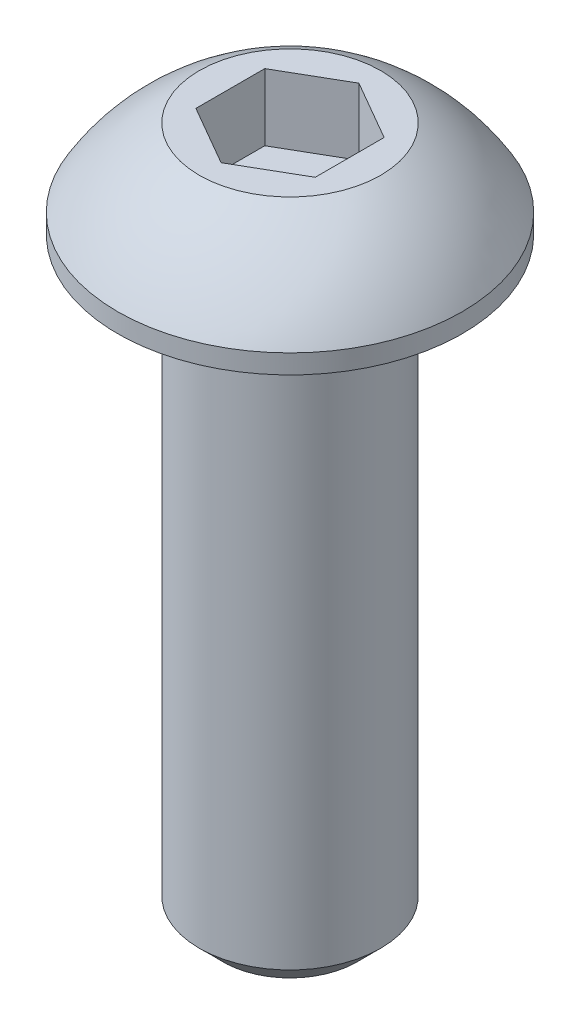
ISO-10303-21;
HEADER;
FILE_DESCRIPTION(('STEP AP214'),'2;1');
FILE_NAME('part.step','',(''),(''),'','','');
FILE_SCHEMA(('AUTOMOTIVE_DESIGN { 1 0 10303 214 1 1 1 1 }'));
ENDSEC;
DATA;
#1=APPLICATION_CONTEXT('core data for automotive mechanical design processes');
#2=APPLICATION_PROTOCOL_DEFINITION('international standard','automotive_design',2000,#1);
#3=PRODUCT_CONTEXT('',#1,'mechanical');
#4=PRODUCT('Part','Part','',(#3));
#5=PRODUCT_RELATED_PRODUCT_CATEGORY('part','',(#4));
#6=PRODUCT_DEFINITION_FORMATION('','',#4);
#7=PRODUCT_DEFINITION_CONTEXT('part definition',#1,'design');
#8=PRODUCT_DEFINITION('design','',#6,#7);
#9=PRODUCT_DEFINITION_SHAPE('','',#8);
#10=(LENGTH_UNIT() NAMED_UNIT(*) SI_UNIT(.MILLI.,.METRE.));
#11=(NAMED_UNIT(*) PLANE_ANGLE_UNIT() SI_UNIT($,.RADIAN.));
#12=(NAMED_UNIT(*) SI_UNIT($,.STERADIAN.) SOLID_ANGLE_UNIT());
#13=UNCERTAINTY_MEASURE_WITH_UNIT(LENGTH_MEASURE(1.E-05),#10,'distance_accuracy_value','');
#14=(GEOMETRIC_REPRESENTATION_CONTEXT(3) GLOBAL_UNCERTAINTY_ASSIGNED_CONTEXT((#13)) GLOBAL_UNIT_ASSIGNED_CONTEXT((#10,
#11,#12)) REPRESENTATION_CONTEXT('',''));
#15=CARTESIAN_POINT('',(0.,0.,0.));
#16=DIRECTION('',(0.,0.,1.));
#17=DIRECTION('',(1.,0.,0.));
#18=AXIS2_PLACEMENT_3D('',#15,#16,#17);
#19=CARTESIAN_POINT('',(0.,0.,0.));
#20=DIRECTION('',(0.,-1.,0.));
#21=DIRECTION('',(0.,0.,-1.));
#22=AXIS2_PLACEMENT_3D('',#19,#20,#21);
#23=PLANE('',#22);
#24=CARTESIAN_POINT('',(0.,0.,0.));
#25=DIRECTION('',(0.,-1.,0.));
#26=DIRECTION('',(0.,0.,-1.));
#27=AXIS2_PLACEMENT_3D('',#24,#25,#26);
#28=CIRCLE('',#27,2.413);
#29=CARTESIAN_POINT('',(0.,0.,-2.413));
#30=VERTEX_POINT('',#29);
#31=EDGE_CURVE('E11',#30,#30,#28,.T.);
#32=ORIENTED_EDGE('',*,*,#31,.F.);
#33=EDGE_LOOP('',(#32));
#34=FACE_BOUND('',#33,.T.);
#35=CARTESIAN_POINT('',(0.,0.,0.));
#36=DIRECTION('',(0.,-1.,0.));
#37=DIRECTION('',(0.,0.,-1.));
#38=AXIS2_PLACEMENT_3D('',#35,#36,#37);
#39=CIRCLE('',#38,4.5847);
#40=CARTESIAN_POINT('',(0.,0.,-4.5847));
#41=VERTEX_POINT('',#40);
#42=EDGE_CURVE('E33',#41,#41,#39,.T.);
#43=ORIENTED_EDGE('',*,*,#42,.T.);
#44=EDGE_LOOP('',(#43));
#45=FACE_BOUND('',#44,.T.);
#46=ADVANCED_FACE('F26',(#34,#45),#23,.T.);
#47=CARTESIAN_POINT('',(0.,0.,0.));
#48=DIRECTION('',(0.,-1.,0.));
#49=DIRECTION('',(0.,0.,-1.));
#50=AXIS2_PLACEMENT_3D('',#47,#48,#49);
#51=CYLINDRICAL_SURFACE('',#50,4.5847);
#52=CARTESIAN_POINT('',(0.,0.508000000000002,0.));
#53=DIRECTION('',(0.,-1.,0.));
#54=DIRECTION('',(0.,0.,-1.));
#55=AXIS2_PLACEMENT_3D('',#52,#53,#54);
#56=CIRCLE('',#55,4.5847);
#57=CARTESIAN_POINT('',(4.58470000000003,0.508000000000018,0.));
#58=VERTEX_POINT('',#57);
#59=EDGE_CURVE('E143',#58,#58,#56,.T.);
#60=ORIENTED_EDGE('',*,*,#59,.T.);
#61=EDGE_LOOP('',(#60));
#62=FACE_BOUND('',#61,.T.);
#63=ORIENTED_EDGE('',*,*,#42,.F.);
#64=EDGE_LOOP('',(#63));
#65=FACE_BOUND('',#64,.T.);
#66=ADVANCED_FACE('F149',(#62,#65),#51,.T.);
#67=CARTESIAN_POINT('',(0.,-2.15653055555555,0.));
#68=DIRECTION('',(0.,-1.,0.));
#69=DIRECTION('',(1.,0.,0.));
#70=AXIS2_PLACEMENT_3D('',#67,#68,#69);
#71=SPHERICAL_SURFACE('',#70,5.30275373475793);
#72=CARTESIAN_POINT('',(0.,2.5654,0.));
#73=DIRECTION('',(0.,-1.,0.));
#74=DIRECTION('',(0.,0.,-1.));
#75=AXIS2_PLACEMENT_3D('',#72,#73,#74);
#76=CIRCLE('',#75,2.413);
#77=CARTESIAN_POINT('',(2.41300000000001,2.56540000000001,0.));
#78=VERTEX_POINT('',#77);
#79=EDGE_CURVE('E140',#78,#78,#76,.T.);
#80=CARTESIAN_POINT('',(2.41300000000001,2.56540000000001,0.));
#81=CARTESIAN_POINT('',(2.44113024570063,2.55102492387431,0.));
#82=CARTESIAN_POINT('',(2.46913200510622,2.53639841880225,0.));
#83=CARTESIAN_POINT('',(2.52486967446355,2.50664734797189,0.));
#84=CARTESIAN_POINT('',(2.55260558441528,2.49152278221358,0.));
#85=CARTESIAN_POINT('',(2.60780267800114,2.4607803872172,0.));
#86=CARTESIAN_POINT('',(2.63526386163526,2.44516255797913,0.));
#87=CARTESIAN_POINT('',(2.68990273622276,2.41343863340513,0.));
#88=CARTESIAN_POINT('',(2.71708042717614,2.3973325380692,0.));
#89=CARTESIAN_POINT('',(2.77114363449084,2.36463722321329,0.));
#90=CARTESIAN_POINT('',(2.79802915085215,2.3480480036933,0.));
#91=CARTESIAN_POINT('',(2.85149942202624,2.31439173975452,0.));
#92=CARTESIAN_POINT('',(2.87808417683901,2.29732469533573,0.));
#93=CARTESIAN_POINT('',(2.93094443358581,2.26271823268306,0.));
#94=CARTESIAN_POINT('',(2.95721993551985,2.24517881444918,0.));
#95=CARTESIAN_POINT('',(3.00945329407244,2.20963320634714,0.));
#96=CARTESIAN_POINT('',(3.03541115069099,2.19162701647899,0.));
#97=CARTESIAN_POINT('',(3.08700092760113,2.15515361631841,0.));
#98=CARTESIAN_POINT('',(3.11263284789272,2.13668640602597,0.));
#99=CARTESIAN_POINT('',(3.16356256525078,2.09929686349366,0.));
#100=CARTESIAN_POINT('',(3.18886036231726,2.08037453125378,0.));
#101=CARTESIAN_POINT('',(3.23911375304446,2.04208078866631,0.));
#102=CARTESIAN_POINT('',(3.26406934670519,2.0227093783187,0.));
#103=CARTESIAN_POINT('',(3.31363035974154,1.98352366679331,0.));
#104=CARTESIAN_POINT('',(3.33823577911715,1.96370936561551,0.));
#105=CARTESIAN_POINT('',(3.38708858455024,1.92364420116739,0.));
#106=CARTESIAN_POINT('',(3.41133597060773,1.90339333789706,0.));
#107=CARTESIAN_POINT('',(3.45946496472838,1.86246151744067,0.));
#108=CARTESIAN_POINT('',(3.48334657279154,1.8417805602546,0.));
#109=CARTESIAN_POINT('',(3.53073638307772,1.79999515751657,0.));
#110=CARTESIAN_POINT('',(3.55424458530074,1.77889071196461,0.));
#111=CARTESIAN_POINT('',(3.60088007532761,1.73626507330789,0.));
#112=CARTESIAN_POINT('',(3.62400736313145,1.71474388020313,0.));
#113=CARTESIAN_POINT('',(3.66987363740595,1.67129162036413,0.));
#114=CARTESIAN_POINT('',(3.69261262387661,1.64936055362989,0.));
#115=CARTESIAN_POINT('',(3.73769503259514,1.60509555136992,0.));
#116=CARTESIAN_POINT('',(3.76003845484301,1.58276161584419,0.));
#117=CARTESIAN_POINT('',(3.80432259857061,1.53769800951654,0.));
#118=CARTESIAN_POINT('',(3.82626332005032,1.51496833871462,0.));
#119=CARTESIAN_POINT('',(3.86973505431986,1.46912052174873,0.));
#120=CARTESIAN_POINT('',(3.89126606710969,1.44600237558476,0.));
#121=CARTESIAN_POINT('',(3.93391150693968,1.39938499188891,0.));
#122=CARTESIAN_POINT('',(3.95502593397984,1.37588575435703,0.));
#123=CARTESIAN_POINT('',(3.99683145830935,1.32851369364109,0.));
#124=CARTESIAN_POINT('',(4.01752255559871,1.30464087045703,0.));
#125=CARTESIAN_POINT('',(4.05847481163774,1.25652926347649,0.));
#126=CARTESIAN_POINT('',(4.07873597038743,1.23229047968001,0.));
#127=CARTESIAN_POINT('',(4.11882187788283,1.18345469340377,0.));
#128=CARTESIAN_POINT('',(4.13864662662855,1.15885769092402,0.));
#129=CARTESIAN_POINT('',(4.17785338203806,1.10931332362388,0.));
#130=CARTESIAN_POINT('',(4.19723538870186,1.0843659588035,0.));
#131=CARTESIAN_POINT('',(4.23555046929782,1.03412883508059,0.));
#132=CARTESIAN_POINT('',(4.25448354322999,1.00883907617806,0.));
#133=CARTESIAN_POINT('',(4.29189471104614,0.957925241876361,0.));
#134=CARTESIAN_POINT('',(4.31037280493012,0.932301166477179,0.));
#135=CARTESIAN_POINT('',(4.34686811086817,0.880726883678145,0.));
#136=CARTESIAN_POINT('',(4.36488532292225,0.854776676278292,0.));
#137=CARTESIAN_POINT('',(4.4004531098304,0.802558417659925,0.));
#138=CARTESIAN_POINT('',(4.41800368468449,0.77629036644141,0.));
#139=CARTESIAN_POINT('',(4.45263259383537,0.723444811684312,0.));
#140=CARTESIAN_POINT('',(4.46971092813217,0.696867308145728,0.));
#141=CARTESIAN_POINT('',(4.50338989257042,0.643411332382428,0.));
#142=CARTESIAN_POINT('',(4.51999052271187,0.61653286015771,0.));
#143=CARTESIAN_POINT('',(4.55270880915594,0.562483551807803,0.));
#144=CARTESIAN_POINT('',(4.56882646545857,0.535312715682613,0.));
#145=CARTESIAN_POINT('',(4.58470000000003,0.508000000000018,0.));
#146=B_SPLINE_CURVE_WITH_KNOTS('',3,(#80,#81,#82,#83,#84,#85,#86,#87,#88,#89,#90,#91,#92,#93,
#94,#95,#96,#97,#98,#99,#100,#101,#102,#103,#104,#105,#106,#107,#108,#109,#110,#111,#112,#113,
#114,#115,#116,#117,#118,#119,#120,#121,#122,#123,#124,#125,#126,#127,#128,#129,#130,#131,#132,
#133,#134,#135,#136,#137,#138,#139,#140,#141,#142,#143,#144,#145),.UNSPECIFIED.,.F.,.F.,(4,2,2,
2,2,2,2,2,2,2,2,2,2,2,2,2,2,2,2,2,2,2,2,2,2,2,2,2,2,2,2,2,4),(0.,0.0947699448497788,
0.189539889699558,0.284309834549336,0.379079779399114,0.473849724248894,0.568619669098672,
0.663389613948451,0.75815955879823,0.852929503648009,0.947699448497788,1.04246939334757,
1.13723933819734,1.23200928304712,1.3267792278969,1.42154917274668,1.51631911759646,
1.61108906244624,1.70585900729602,1.8006289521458,1.89539889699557,1.99016884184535,
2.08493878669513,2.17970873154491,2.27447867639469,2.36924862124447,2.46401856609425,
2.55878851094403,2.6535584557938,2.74832840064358,2.84309834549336,2.93786829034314,
3.03263823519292),.UNSPECIFIED.);
#147=EDGE_CURVE('BSEAM151',#78,#58,#146,.T.);
#148=ORIENTED_EDGE('',*,*,#79,.T.);
#149=ORIENTED_EDGE('',*,*,#59,.F.);
#150=ORIENTED_EDGE('',*,*,#147,.T.);
#151=ORIENTED_EDGE('',*,*,#147,.F.);
#152=EDGE_LOOP('',(#148,#150,#149,#151));
#153=FACE_BOUND('',#152,.T.);
#154=ADVANCED_FACE('F151',(#153),#71,.T.);
#155=CARTESIAN_POINT('',(2.41300000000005,2.56539999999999,0.));
#156=DIRECTION('',(0.,1.,0.));
#157=DIRECTION('',(0.,0.,1.));
#158=AXIS2_PLACEMENT_3D('',#155,#156,#157);
#159=PLANE('',#158);
#160=DIRECTION('',(1.0206947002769E-11,0.,1.));
#161=VECTOR('',#160,1.);
#162=CARTESIAN_POINT('',(-1.58750000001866,2.56540000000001,-0.916543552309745));
#163=LINE('',#162,#161);
#164=CARTESIAN_POINT('',(-1.58750000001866,2.56540000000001,-0.916543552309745));
#165=VERTEX_POINT('',#164);
#166=CARTESIAN_POINT('',(-1.58749999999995,2.56540000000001,0.916543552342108));
#167=VERTEX_POINT('',#166);
#168=EDGE_CURVE('E40',#165,#167,#163,.T.);
#169=ORIENTED_EDGE('',*,*,#168,.F.);
#170=DIRECTION('',(-0.866025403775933,0.,0.500000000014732));
#171=VECTOR('',#170,1.);
#172=CARTESIAN_POINT('',(-2.80053757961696E-11,2.5654,-1.83308710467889));
#173=LINE('',#172,#171);
#174=CARTESIAN_POINT('',(-2.80053757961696E-11,2.5654,-1.83308710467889));
#175=VERTEX_POINT('',#174);
#176=EDGE_CURVE('E110',#175,#165,#173,.T.);
#177=ORIENTED_EDGE('',*,*,#176,.F.);
#178=DIRECTION('',(-0.866025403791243,0.,-0.499999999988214));
#179=VECTOR('',#178,1.);
#180=CARTESIAN_POINT('',(1.58749999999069,2.56539999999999,-0.916543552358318));
#181=LINE('',#180,#179);
#182=CARTESIAN_POINT('',(1.58749999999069,2.56539999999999,-0.916543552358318));
#183=VERTEX_POINT('',#182);
#184=EDGE_CURVE('E104',#183,#175,#181,.T.);
#185=ORIENTED_EDGE('',*,*,#184,.F.);
#186=DIRECTION('',(-1.02068287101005E-11,0.,-1.));
#187=VECTOR('',#186,1.);
#188=CARTESIAN_POINT('',(1.58750000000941,2.56539999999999,0.916543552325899));
#189=LINE('',#188,#187);
#190=CARTESIAN_POINT('',(1.58750000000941,2.56539999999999,0.916543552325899));
#191=VERTEX_POINT('',#190);
#192=EDGE_CURVE('E102',#191,#183,#189,.T.);
#193=ORIENTED_EDGE('',*,*,#192,.F.);
#194=DIRECTION('',(0.866025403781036,0.,-0.500000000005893));
#195=VECTOR('',#194,1.);
#196=CARTESIAN_POINT('',(9.39526234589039E-12,2.5654,1.83308710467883));
#197=LINE('',#196,#195);
#198=CARTESIAN_POINT('',(9.39526234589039E-12,2.5654,1.83308710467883));
#199=VERTEX_POINT('',#198);
#200=EDGE_CURVE('E83',#199,#191,#197,.T.);
#201=ORIENTED_EDGE('',*,*,#200,.F.);
#202=DIRECTION('',(0.86602540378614,0.,0.499999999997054));
#203=VECTOR('',#202,1.);
#204=CARTESIAN_POINT('',(-1.58749999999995,2.56540000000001,0.916543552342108));
#205=LINE('',#204,#203);
#206=EDGE_CURVE('E94',#167,#199,#205,.T.);
#207=ORIENTED_EDGE('',*,*,#206,.F.);
#208=EDGE_LOOP('',(#169,#177,#185,#193,#201,#207));
#209=FACE_BOUND('',#208,.T.);
#210=ORIENTED_EDGE('',*,*,#79,.F.);
#211=EDGE_LOOP('',(#210));
#212=FACE_BOUND('',#211,.T.);
#213=ADVANCED_FACE('F98',(#209,#212),#159,.T.);
#214=CARTESIAN_POINT('',(1.11022302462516E-13,-15.875,0.));
#215=DIRECTION('',(0.,-1.,0.));
#216=DIRECTION('',(0.,0.,-1.));
#217=AXIS2_PLACEMENT_3D('',#214,#215,#216);
#218=PLANE('',#217);
#219=CARTESIAN_POINT('',(1.11022302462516E-13,-15.875,0.));
#220=DIRECTION('',(0.,-1.,0.));
#221=DIRECTION('',(0.,0.,-1.));
#222=AXIS2_PLACEMENT_3D('',#219,#220,#221);
#223=CIRCLE('',#222,1.78308);
#224=CARTESIAN_POINT('',(1.10880248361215E-13,-15.875,-1.78308));
#225=VERTEX_POINT('',#224);
#226=EDGE_CURVE('E137',#225,#225,#223,.T.);
#227=ORIENTED_EDGE('',*,*,#226,.T.);
#228=EDGE_LOOP('',(#227));
#229=FACE_BOUND('',#228,.T.);
#230=ADVANCED_FACE('F163',(#229),#218,.T.);
#231=CARTESIAN_POINT('',(1.11022302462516E-13,-15.875,0.));
#232=DIRECTION('',(0.,1.,0.));
#233=DIRECTION('',(0.,0.,1.));
#234=AXIS2_PLACEMENT_3D('',#231,#232,#233);
#235=CONICAL_SURFACE('',#234,1.78308,0.785398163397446);
#236=CARTESIAN_POINT('',(1.11022302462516E-13,-15.24508,0.));
#237=DIRECTION('',(0.,-1.,0.));
#238=DIRECTION('',(0.,0.,-1.));
#239=AXIS2_PLACEMENT_3D('',#236,#237,#238);
#240=CIRCLE('',#239,2.413);
#241=CARTESIAN_POINT('',(1.10830064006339E-13,-15.24508,-2.413));
#242=VERTEX_POINT('',#241);
#243=EDGE_CURVE('E128',#242,#242,#240,.T.);
#244=ORIENTED_EDGE('',*,*,#243,.T.);
#245=EDGE_LOOP('',(#244));
#246=FACE_BOUND('',#245,.T.);
#247=ORIENTED_EDGE('',*,*,#226,.F.);
#248=EDGE_LOOP('',(#247));
#249=FACE_BOUND('',#248,.T.);
#250=ADVANCED_FACE('F166',(#246,#249),#235,.T.);
#251=CARTESIAN_POINT('',(0.,0.,0.));
#252=DIRECTION('',(0.,-1.,0.));
#253=DIRECTION('',(0.,0.,-1.));
#254=AXIS2_PLACEMENT_3D('',#251,#252,#253);
#255=CYLINDRICAL_SURFACE('',#254,2.413);
#256=ORIENTED_EDGE('',*,*,#31,.T.);
#257=EDGE_LOOP('',(#256));
#258=FACE_BOUND('',#257,.T.);
#259=ORIENTED_EDGE('',*,*,#243,.F.);
#260=EDGE_LOOP('',(#259));
#261=FACE_BOUND('',#260,.T.);
#262=ADVANCED_FACE('F170',(#258,#261),#255,.T.);
#263=CARTESIAN_POINT('',(-1.58750000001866,0.787400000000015,-0.916543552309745));
#264=DIRECTION('',(-1.,0.,1.02067876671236E-11));
#265=DIRECTION('',(1.0206947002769E-11,0.,1.));
#266=AXIS2_PLACEMENT_3D('',#263,#264,#265);
#267=PLANE('',#266);
#268=ORIENTED_EDGE('',*,*,#168,.T.);
#269=DIRECTION('',(0.,1.,0.));
#270=VECTOR('',#269,1.);
#271=CARTESIAN_POINT('',(-1.58749999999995,0.787400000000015,0.916543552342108));
#272=LINE('',#271,#270);
#273=CARTESIAN_POINT('',(-1.58749999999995,0.787400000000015,0.916543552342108));
#274=VERTEX_POINT('',#273);
#275=EDGE_CURVE('E91',#274,#167,#272,.T.);
#276=ORIENTED_EDGE('',*,*,#275,.F.);
#277=DIRECTION('',(1.0206947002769E-11,0.,1.));
#278=VECTOR('',#277,1.);
#279=CARTESIAN_POINT('',(-1.58750000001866,0.787400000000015,-0.916543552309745));
#280=LINE('',#279,#278);
#281=CARTESIAN_POINT('',(-1.58750000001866,0.787400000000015,-0.916543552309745));
#282=VERTEX_POINT('',#281);
#283=EDGE_CURVE('E112',#282,#274,#280,.T.);
#284=ORIENTED_EDGE('',*,*,#283,.F.);
#285=DIRECTION('',(0.,1.,0.));
#286=VECTOR('',#285,1.);
#287=CARTESIAN_POINT('',(-1.58750000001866,0.787400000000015,-0.916543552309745));
#288=LINE('',#287,#286);
#289=EDGE_CURVE('E47',#282,#165,#288,.T.);
#290=ORIENTED_EDGE('',*,*,#289,.T.);
#291=EDGE_LOOP('',(#268,#276,#284,#290));
#292=FACE_BOUND('',#291,.T.);
#293=ADVANCED_FACE('F174',(#292),#267,.F.);
#294=CARTESIAN_POINT('',(-2.80053757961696E-11,0.787400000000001,-1.83308710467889));
#295=DIRECTION('',(-0.500000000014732,0.,-0.866025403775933));
#296=DIRECTION('',(-0.866025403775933,0.,0.500000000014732));
#297=AXIS2_PLACEMENT_3D('',#294,#295,#296);
#298=PLANE('',#297);
#299=ORIENTED_EDGE('',*,*,#176,.T.);
#300=ORIENTED_EDGE('',*,*,#289,.F.);
#301=DIRECTION('',(-0.866025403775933,0.,0.500000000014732));
#302=VECTOR('',#301,1.);
#303=CARTESIAN_POINT('',(-2.80053757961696E-11,0.787400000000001,-1.83308710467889));
#304=LINE('',#303,#302);
#305=CARTESIAN_POINT('',(-2.80053757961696E-11,0.787400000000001,-1.83308710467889));
#306=VERTEX_POINT('',#305);
#307=EDGE_CURVE('E124',#306,#282,#304,.T.);
#308=ORIENTED_EDGE('',*,*,#307,.F.);
#309=DIRECTION('',(0.,1.,0.));
#310=VECTOR('',#309,1.);
#311=CARTESIAN_POINT('',(-2.80053757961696E-11,0.787400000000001,-1.83308710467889));
#312=LINE('',#311,#310);
#313=EDGE_CURVE('E129',#306,#175,#312,.T.);
#314=ORIENTED_EDGE('',*,*,#313,.T.);
#315=EDGE_LOOP('',(#299,#300,#308,#314));
#316=FACE_BOUND('',#315,.T.);
#317=ADVANCED_FACE('F178',(#316),#298,.F.);
#318=CARTESIAN_POINT('',(1.58749999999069,0.787399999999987,-0.916543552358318));
#319=DIRECTION('',(0.499999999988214,0.,-0.866025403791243));
#320=DIRECTION('',(-0.866025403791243,0.,-0.499999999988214));
#321=AXIS2_PLACEMENT_3D('',#318,#319,#320);
#322=PLANE('',#321);
#323=ORIENTED_EDGE('',*,*,#184,.T.);
#324=ORIENTED_EDGE('',*,*,#313,.F.);
#325=DIRECTION('',(-0.866025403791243,0.,-0.499999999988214));
#326=VECTOR('',#325,1.);
#327=CARTESIAN_POINT('',(1.58749999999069,0.787399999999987,-0.916543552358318));
#328=LINE('',#327,#326);
#329=CARTESIAN_POINT('',(1.58749999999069,0.787399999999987,-0.916543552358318));
#330=VERTEX_POINT('',#329);
#331=EDGE_CURVE('E121',#330,#306,#328,.T.);
#332=ORIENTED_EDGE('',*,*,#331,.F.);
#333=DIRECTION('',(0.,1.,0.));
#334=VECTOR('',#333,1.);
#335=CARTESIAN_POINT('',(1.58749999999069,0.787399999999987,-0.916543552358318));
#336=LINE('',#335,#334);
#337=EDGE_CURVE('E131',#330,#183,#336,.T.);
#338=ORIENTED_EDGE('',*,*,#337,.T.);
#339=EDGE_LOOP('',(#323,#324,#332,#338));
#340=FACE_BOUND('',#339,.T.);
#341=ADVANCED_FACE('F187',(#340),#322,.F.);
#342=CARTESIAN_POINT('',(1.58750000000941,0.787399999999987,0.916543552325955));
#343=DIRECTION('',(1.,0.,-1.02066693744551E-11));
#344=DIRECTION('',(-1.02068287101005E-11,0.,-1.));
#345=AXIS2_PLACEMENT_3D('',#342,#343,#344);
#346=PLANE('',#345);
#347=ORIENTED_EDGE('',*,*,#192,.T.);
#348=ORIENTED_EDGE('',*,*,#337,.F.);
#349=DIRECTION('',(-1.02068287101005E-11,0.,-1.));
#350=VECTOR('',#349,1.);
#351=CARTESIAN_POINT('',(1.58750000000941,0.787399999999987,0.916543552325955));
#352=LINE('',#351,#350);
#353=CARTESIAN_POINT('',(1.58750000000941,0.787399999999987,0.916543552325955));
#354=VERTEX_POINT('',#353);
#355=EDGE_CURVE('E118',#354,#330,#352,.T.);
#356=ORIENTED_EDGE('',*,*,#355,.F.);
#357=DIRECTION('',(0.,1.,0.));
#358=VECTOR('',#357,1.);
#359=CARTESIAN_POINT('',(1.58750000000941,0.787399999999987,0.916543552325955));
#360=LINE('',#359,#358);
#361=EDGE_CURVE('E90',#354,#191,#360,.T.);
#362=ORIENTED_EDGE('',*,*,#361,.T.);
#363=EDGE_LOOP('',(#347,#348,#356,#362));
#364=FACE_BOUND('',#363,.T.);
#365=ADVANCED_FACE('F184',(#364),#346,.F.);
#366=CARTESIAN_POINT('',(9.4091401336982E-12,0.787400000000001,1.83308710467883));
#367=DIRECTION('',(0.500000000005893,0.,0.866025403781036));
#368=DIRECTION('',(0.866025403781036,0.,-0.500000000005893));
#369=AXIS2_PLACEMENT_3D('',#366,#367,#368);
#370=PLANE('',#369);
#371=ORIENTED_EDGE('',*,*,#200,.T.);
#372=ORIENTED_EDGE('',*,*,#361,.F.);
#373=DIRECTION('',(0.866025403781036,0.,-0.500000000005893));
#374=VECTOR('',#373,1.);
#375=CARTESIAN_POINT('',(9.4091401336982E-12,0.787400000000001,1.83308710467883));
#376=LINE('',#375,#374);
#377=CARTESIAN_POINT('',(9.4091401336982E-12,0.787400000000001,1.83308710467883));
#378=VERTEX_POINT('',#377);
#379=EDGE_CURVE('E86',#378,#354,#376,.T.);
#380=ORIENTED_EDGE('',*,*,#379,.F.);
#381=DIRECTION('',(0.,1.,0.));
#382=VECTOR('',#381,1.);
#383=CARTESIAN_POINT('',(9.4091401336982E-12,0.787400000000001,1.83308710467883));
#384=LINE('',#383,#382);
#385=EDGE_CURVE('E79',#378,#199,#384,.T.);
#386=ORIENTED_EDGE('',*,*,#385,.T.);
#387=EDGE_LOOP('',(#371,#372,#380,#386));
#388=FACE_BOUND('',#387,.T.);
#389=ADVANCED_FACE('F81',(#388),#370,.F.);
#390=CARTESIAN_POINT('',(-1.58749999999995,0.787400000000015,0.916543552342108));
#391=DIRECTION('',(-0.499999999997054,0.,0.86602540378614));
#392=DIRECTION('',(0.86602540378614,0.,0.499999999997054));
#393=AXIS2_PLACEMENT_3D('',#390,#391,#392);
#394=PLANE('',#393);
#395=ORIENTED_EDGE('',*,*,#206,.T.);
#396=ORIENTED_EDGE('',*,*,#385,.F.);
#397=DIRECTION('',(0.86602540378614,0.,0.499999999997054));
#398=VECTOR('',#397,1.);
#399=CARTESIAN_POINT('',(-1.58749999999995,0.787400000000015,0.916543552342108));
#400=LINE('',#399,#398);
#401=EDGE_CURVE('E115',#274,#378,#400,.T.);
#402=ORIENTED_EDGE('',*,*,#401,.F.);
#403=ORIENTED_EDGE('',*,*,#275,.T.);
#404=EDGE_LOOP('',(#395,#396,#402,#403));
#405=FACE_BOUND('',#404,.T.);
#406=ADVANCED_FACE('F95',(#405),#394,.F.);
#407=CARTESIAN_POINT('',(-1.58749999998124,0.787400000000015,2.74963065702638));
#408=DIRECTION('',(0.,1.,0.));
#409=DIRECTION('',(0.,0.,1.));
#410=AXIS2_PLACEMENT_3D('',#407,#408,#409);
#411=PLANE('',#410);
#412=ORIENTED_EDGE('',*,*,#283,.T.);
#413=ORIENTED_EDGE('',*,*,#401,.T.);
#414=ORIENTED_EDGE('',*,*,#379,.T.);
#415=ORIENTED_EDGE('',*,*,#355,.T.);
#416=ORIENTED_EDGE('',*,*,#331,.T.);
#417=ORIENTED_EDGE('',*,*,#307,.T.);
#418=EDGE_LOOP('',(#412,#413,#414,#415,#416,#417));
#419=FACE_BOUND('',#418,.T.);
#420=ADVANCED_FACE('F181',(#419),#411,.T.);
#421=CLOSED_SHELL('',(#46,#66,#154,#213,#230,#250,#262,#293,#317,#341,#365,#389,#406,#420));
#422=MANIFOLD_SOLID_BREP('B2',#421);
#423=ADVANCED_BREP_SHAPE_REPRESENTATION('',(#18,#422),#14);
#424=SHAPE_DEFINITION_REPRESENTATION(#9,#423);
ENDSEC;
END-ISO-10303-21;
